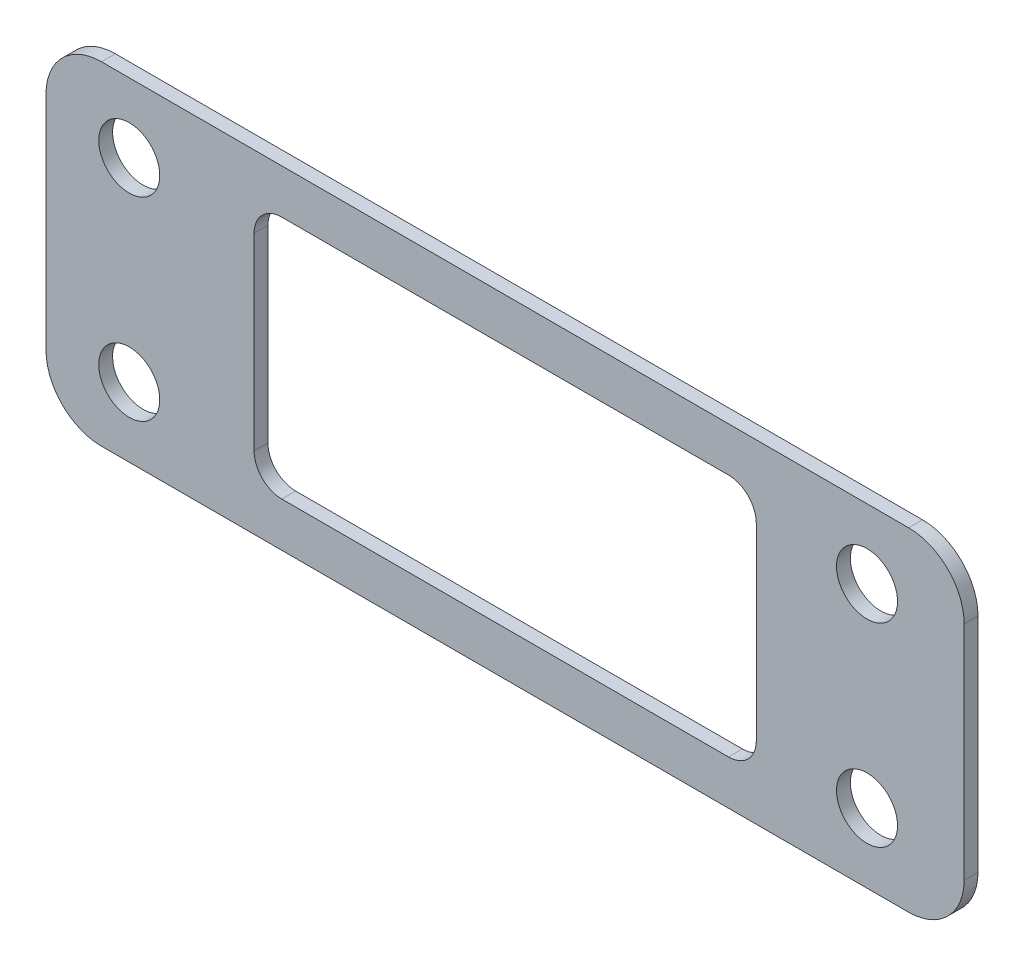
ISO-10303-21;
HEADER;
FILE_DESCRIPTION(('STEP AP214'),'2;1');
FILE_NAME('part.step','',(''),(''),'','','');
FILE_SCHEMA(('AUTOMOTIVE_DESIGN { 1 0 10303 214 1 1 1 1 }'));
ENDSEC;
DATA;
#1=APPLICATION_CONTEXT('core data for automotive mechanical design processes');
#2=APPLICATION_PROTOCOL_DEFINITION('international standard','automotive_design',2000,#1);
#3=PRODUCT_CONTEXT('',#1,'mechanical');
#4=PRODUCT('Part','Part','',(#3));
#5=PRODUCT_RELATED_PRODUCT_CATEGORY('part','',(#4));
#6=PRODUCT_DEFINITION_FORMATION('','',#4);
#7=PRODUCT_DEFINITION_CONTEXT('part definition',#1,'design');
#8=PRODUCT_DEFINITION('design','',#6,#7);
#9=PRODUCT_DEFINITION_SHAPE('','',#8);
#10=(LENGTH_UNIT() NAMED_UNIT(*) SI_UNIT(.MILLI.,.METRE.));
#11=(NAMED_UNIT(*) PLANE_ANGLE_UNIT() SI_UNIT($,.RADIAN.));
#12=(NAMED_UNIT(*) SI_UNIT($,.STERADIAN.) SOLID_ANGLE_UNIT());
#13=UNCERTAINTY_MEASURE_WITH_UNIT(LENGTH_MEASURE(1.E-05),#10,'distance_accuracy_value','');
#14=(GEOMETRIC_REPRESENTATION_CONTEXT(3) GLOBAL_UNCERTAINTY_ASSIGNED_CONTEXT((#13)) GLOBAL_UNIT_ASSIGNED_CONTEXT((#10,
#11,#12)) REPRESENTATION_CONTEXT('',''));
#15=CARTESIAN_POINT('',(0.,0.,0.));
#16=DIRECTION('',(0.,0.,1.));
#17=DIRECTION('',(1.,0.,0.));
#18=AXIS2_PLACEMENT_3D('',#15,#16,#17);
#19=CARTESIAN_POINT('',(818.894201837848,60.,-1011.41695165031));
#20=DIRECTION('',(0.,-1.,0.));
#21=DIRECTION('',(0.,0.,-1.));
#22=AXIS2_PLACEMENT_3D('',#19,#20,#21);
#23=PLANE('',#22);
#24=DIRECTION('',(-1.,0.,0.));
#25=VECTOR('',#24,1.);
#26=CARTESIAN_POINT('',(818.894201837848,60.,-1016.41695165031));
#27=LINE('',#26,#25);
#28=CARTESIAN_POINT('',(798.894201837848,60.,-1016.41695165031));
#29=VERTEX_POINT('',#28);
#30=CARTESIAN_POINT('',(507.97537091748,60.,-1016.41695165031));
#31=VERTEX_POINT('',#30);
#32=EDGE_CURVE('E296',#29,#31,#27,.T.);
#33=ORIENTED_EDGE('',*,*,#32,.T.);
#34=DIRECTION('',(0.,0.,1.));
#35=VECTOR('',#34,1.);
#36=CARTESIAN_POINT('',(507.97537091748,60.,-1011.41695165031));
#37=LINE('',#36,#35);
#38=CARTESIAN_POINT('',(507.97537091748,60.,-1011.41695165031));
#39=VERTEX_POINT('',#38);
#40=EDGE_CURVE('E166',#31,#39,#37,.T.);
#41=ORIENTED_EDGE('',*,*,#40,.T.);
#42=DIRECTION('',(-1.,0.,0.));
#43=VECTOR('',#42,1.);
#44=CARTESIAN_POINT('',(818.894201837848,60.,-1011.41695165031));
#45=LINE('',#44,#43);
#46=CARTESIAN_POINT('',(798.894201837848,60.,-1011.41695165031));
#47=VERTEX_POINT('',#46);
#48=EDGE_CURVE('E150',#47,#39,#45,.T.);
#49=ORIENTED_EDGE('',*,*,#48,.F.);
#50=DIRECTION('',(0.,0.,1.));
#51=VECTOR('',#50,1.);
#52=CARTESIAN_POINT('',(798.894201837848,60.,-1016.41695165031));
#53=LINE('',#52,#51);
#54=EDGE_CURVE('E163',#47,#29,#53,.F.);
#55=ORIENTED_EDGE('',*,*,#54,.T.);
#56=EDGE_LOOP('',(#33,#41,#49,#55));
#57=FACE_BOUND('',#56,.T.);
#58=ADVANCED_FACE('F34',(#57),#23,.F.);
#59=CARTESIAN_POINT('',(818.894201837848,-60.,-1011.41695165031));
#60=DIRECTION('',(0.,0.,-1.));
#61=DIRECTION('',(0.,1.,0.));
#62=AXIS2_PLACEMENT_3D('',#59,#60,#61);
#63=PLANE('',#62);
#64=DIRECTION('',(0.,1.,0.));
#65=VECTOR('',#64,1.);
#66=CARTESIAN_POINT('',(562.97537091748,44.0000000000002,-1011.41695165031));
#67=LINE('',#66,#65);
#68=CARTESIAN_POINT('',(562.97537091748,-34.0000000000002,-1011.41695165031));
#69=VERTEX_POINT('',#68);
#70=CARTESIAN_POINT('',(562.97537091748,34.0000000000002,-1011.41695165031));
#71=VERTEX_POINT('',#70);
#72=EDGE_CURVE('E249',#69,#71,#67,.T.);
#73=ORIENTED_EDGE('',*,*,#72,.T.);
#74=CARTESIAN_POINT('',(572.97537091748,34.0000000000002,-1011.41695165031));
#75=DIRECTION('',(0.,0.,-1.));
#76=DIRECTION('',(0.,1.,0.));
#77=AXIS2_PLACEMENT_3D('',#74,#75,#76);
#78=CIRCLE('',#77,10.);
#79=CARTESIAN_POINT('',(572.97537091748,44.0000000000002,-1011.41695165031));
#80=VERTEX_POINT('',#79);
#81=EDGE_CURVE('E230',#71,#80,#78,.T.);
#82=ORIENTED_EDGE('',*,*,#81,.T.);
#83=DIRECTION('',(1.,0.,0.));
#84=VECTOR('',#83,1.);
#85=CARTESIAN_POINT('',(743.97537091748,44.0000000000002,-1011.41695165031));
#86=LINE('',#85,#84);
#87=CARTESIAN_POINT('',(733.97537091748,44.0000000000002,-1011.41695165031));
#88=VERTEX_POINT('',#87);
#89=EDGE_CURVE('E251',#80,#88,#86,.T.);
#90=ORIENTED_EDGE('',*,*,#89,.T.);
#91=CARTESIAN_POINT('',(733.97537091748,34.0000000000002,-1011.41695165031));
#92=DIRECTION('',(0.,0.,-1.));
#93=DIRECTION('',(0.,1.,0.));
#94=AXIS2_PLACEMENT_3D('',#91,#92,#93);
#95=CIRCLE('',#94,10.);
#96=CARTESIAN_POINT('',(743.97537091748,34.0000000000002,-1011.41695165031));
#97=VERTEX_POINT('',#96);
#98=EDGE_CURVE('E222',#88,#97,#95,.T.);
#99=ORIENTED_EDGE('',*,*,#98,.T.);
#100=DIRECTION('',(0.,-1.,0.));
#101=VECTOR('',#100,1.);
#102=CARTESIAN_POINT('',(743.97537091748,44.0000000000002,-1011.41695165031));
#103=LINE('',#102,#101);
#104=CARTESIAN_POINT('',(743.97537091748,-34.0000000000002,-1011.41695165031));
#105=VERTEX_POINT('',#104);
#106=EDGE_CURVE('E257',#97,#105,#103,.T.);
#107=ORIENTED_EDGE('',*,*,#106,.T.);
#108=CARTESIAN_POINT('',(733.97537091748,-34.0000000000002,-1011.41695165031));
#109=DIRECTION('',(0.,0.,-1.));
#110=DIRECTION('',(0.,1.,0.));
#111=AXIS2_PLACEMENT_3D('',#108,#109,#110);
#112=CIRCLE('',#111,10.);
#113=CARTESIAN_POINT('',(733.97537091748,-44.0000000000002,-1011.41695165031));
#114=VERTEX_POINT('',#113);
#115=EDGE_CURVE('E226',#105,#114,#112,.T.);
#116=ORIENTED_EDGE('',*,*,#115,.T.);
#117=DIRECTION('',(-1.,0.,0.));
#118=VECTOR('',#117,1.);
#119=CARTESIAN_POINT('',(743.97537091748,-44.0000000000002,-1011.41695165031));
#120=LINE('',#119,#118);
#121=CARTESIAN_POINT('',(572.97537091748,-44.0000000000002,-1011.41695165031));
#122=VERTEX_POINT('',#121);
#123=EDGE_CURVE('E252',#114,#122,#120,.T.);
#124=ORIENTED_EDGE('',*,*,#123,.T.);
#125=CARTESIAN_POINT('',(572.97537091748,-34.0000000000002,-1011.41695165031));
#126=DIRECTION('',(0.,0.,-1.));
#127=DIRECTION('',(0.,1.,0.));
#128=AXIS2_PLACEMENT_3D('',#125,#126,#127);
#129=CIRCLE('',#128,10.);
#130=EDGE_CURVE('E11',#122,#69,#129,.T.);
#131=ORIENTED_EDGE('',*,*,#130,.T.);
#132=EDGE_LOOP('',(#73,#82,#90,#99,#107,#116,#124,#131));
#133=FACE_BOUND('',#132,.T.);
#134=CARTESIAN_POINT('',(783.894201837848,-35.,-1011.41695165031));
#135=DIRECTION('',(0.,0.,-1.));
#136=DIRECTION('',(0.,1.,0.));
#137=AXIS2_PLACEMENT_3D('',#134,#135,#136);
#138=CIRCLE('',#137,11.);
#139=CARTESIAN_POINT('',(783.894201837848,-24.,-1011.41695165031));
#140=VERTEX_POINT('',#139);
#141=EDGE_CURVE('E287',#140,#140,#138,.T.);
#142=ORIENTED_EDGE('',*,*,#141,.T.);
#143=EDGE_LOOP('',(#142));
#144=FACE_BOUND('',#143,.T.);
#145=CARTESIAN_POINT('',(517.97537091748,35.,-1011.41695165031));
#146=DIRECTION('',(0.,0.,-1.));
#147=DIRECTION('',(0.,1.,0.));
#148=AXIS2_PLACEMENT_3D('',#145,#146,#147);
#149=CIRCLE('',#148,11.);
#150=CARTESIAN_POINT('',(517.97537091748,46.,-1011.41695165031));
#151=VERTEX_POINT('',#150);
#152=EDGE_CURVE('E284',#151,#151,#149,.T.);
#153=ORIENTED_EDGE('',*,*,#152,.T.);
#154=EDGE_LOOP('',(#153));
#155=FACE_BOUND('',#154,.T.);
#156=CARTESIAN_POINT('',(517.97537091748,-35.,-1011.41695165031));
#157=DIRECTION('',(0.,0.,-1.));
#158=DIRECTION('',(0.,1.,0.));
#159=AXIS2_PLACEMENT_3D('',#156,#157,#158);
#160=CIRCLE('',#159,11.);
#161=CARTESIAN_POINT('',(517.97537091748,-24.,-1011.41695165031));
#162=VERTEX_POINT('',#161);
#163=EDGE_CURVE('E281',#162,#162,#160,.T.);
#164=ORIENTED_EDGE('',*,*,#163,.T.);
#165=EDGE_LOOP('',(#164));
#166=FACE_BOUND('',#165,.T.);
#167=CARTESIAN_POINT('',(783.894201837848,35.,-1011.41695165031));
#168=DIRECTION('',(0.,0.,-1.));
#169=DIRECTION('',(0.,1.,0.));
#170=AXIS2_PLACEMENT_3D('',#167,#168,#169);
#171=CIRCLE('',#170,11.);
#172=CARTESIAN_POINT('',(783.894201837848,46.,-1011.41695165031));
#173=VERTEX_POINT('',#172);
#174=EDGE_CURVE('E278',#173,#173,#171,.T.);
#175=ORIENTED_EDGE('',*,*,#174,.T.);
#176=EDGE_LOOP('',(#175));
#177=FACE_BOUND('',#176,.T.);
#178=ORIENTED_EDGE('',*,*,#48,.T.);
#179=CARTESIAN_POINT('',(507.97537091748,40.,-1011.41695165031));
#180=DIRECTION('',(0.,0.,-1.));
#181=DIRECTION('',(0.,1.,0.));
#182=AXIS2_PLACEMENT_3D('',#179,#180,#181);
#183=CIRCLE('',#182,20.);
#184=CARTESIAN_POINT('',(487.97537091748,39.9999999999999,-1011.41695165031));
#185=VERTEX_POINT('',#184);
#186=EDGE_CURVE('E178',#39,#185,#183,.F.);
#187=ORIENTED_EDGE('',*,*,#186,.T.);
#188=DIRECTION('',(0.,-1.,0.));
#189=VECTOR('',#188,1.);
#190=CARTESIAN_POINT('',(487.97537091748,-60.,-1011.41695165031));
#191=LINE('',#190,#189);
#192=CARTESIAN_POINT('',(487.97537091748,-40.,-1011.41695165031));
#193=VERTEX_POINT('',#192);
#194=EDGE_CURVE('E290',#185,#193,#191,.T.);
#195=ORIENTED_EDGE('',*,*,#194,.T.);
#196=CARTESIAN_POINT('',(507.97537091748,-40.,-1011.41695165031));
#197=DIRECTION('',(0.,0.,-1.));
#198=DIRECTION('',(0.,1.,0.));
#199=AXIS2_PLACEMENT_3D('',#196,#197,#198);
#200=CIRCLE('',#199,20.);
#201=CARTESIAN_POINT('',(507.97537091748,-60.,-1011.41695165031));
#202=VERTEX_POINT('',#201);
#203=EDGE_CURVE('E157',#193,#202,#200,.F.);
#204=ORIENTED_EDGE('',*,*,#203,.T.);
#205=DIRECTION('',(-1.,0.,0.));
#206=VECTOR('',#205,1.);
#207=CARTESIAN_POINT('',(818.894201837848,-60.,-1011.41695165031));
#208=LINE('',#207,#206);
#209=CARTESIAN_POINT('',(798.894201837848,-60.,-1011.41695165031));
#210=VERTEX_POINT('',#209);
#211=EDGE_CURVE('E167',#210,#202,#208,.T.);
#212=ORIENTED_EDGE('',*,*,#211,.F.);
#213=CARTESIAN_POINT('',(798.894201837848,-40.,-1011.41695165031));
#214=DIRECTION('',(0.,0.,-1.));
#215=DIRECTION('',(0.,1.,0.));
#216=AXIS2_PLACEMENT_3D('',#213,#214,#215);
#217=CIRCLE('',#216,20.);
#218=CARTESIAN_POINT('',(818.894201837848,-40.,-1011.41695165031));
#219=VERTEX_POINT('',#218);
#220=EDGE_CURVE('E158',#210,#219,#217,.F.);
#221=ORIENTED_EDGE('',*,*,#220,.T.);
#222=DIRECTION('',(0.,-1.,0.));
#223=VECTOR('',#222,1.);
#224=CARTESIAN_POINT('',(818.894201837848,-60.,-1011.41695165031));
#225=LINE('',#224,#223);
#226=CARTESIAN_POINT('',(818.894201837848,39.9999999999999,-1011.41695165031));
#227=VERTEX_POINT('',#226);
#228=EDGE_CURVE('E152',#227,#219,#225,.T.);
#229=ORIENTED_EDGE('',*,*,#228,.F.);
#230=CARTESIAN_POINT('',(798.894201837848,40.,-1011.41695165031));
#231=DIRECTION('',(0.,0.,-1.));
#232=DIRECTION('',(0.,1.,0.));
#233=AXIS2_PLACEMENT_3D('',#230,#231,#232);
#234=CIRCLE('',#233,20.);
#235=EDGE_CURVE('E147',#227,#47,#234,.F.);
#236=ORIENTED_EDGE('',*,*,#235,.T.);
#237=EDGE_LOOP('',(#178,#187,#195,#204,#212,#221,#229,#236));
#238=FACE_BOUND('',#237,.T.);
#239=ADVANCED_FACE('F149',(#133,#144,#155,#166,#177,#238),#63,.F.);
#240=CARTESIAN_POINT('',(818.894201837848,-60.,-1011.41695165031));
#241=DIRECTION('',(0.,1.,0.));
#242=DIRECTION('',(0.,0.,1.));
#243=AXIS2_PLACEMENT_3D('',#240,#241,#242);
#244=PLANE('',#243);
#245=ORIENTED_EDGE('',*,*,#211,.T.);
#246=DIRECTION('',(0.,0.,-1.));
#247=VECTOR('',#246,1.);
#248=CARTESIAN_POINT('',(507.97537091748,-60.,-1011.41695165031));
#249=LINE('',#248,#247);
#250=CARTESIAN_POINT('',(507.97537091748,-60.,-1016.41695165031));
#251=VERTEX_POINT('',#250);
#252=EDGE_CURVE('E193',#202,#251,#249,.T.);
#253=ORIENTED_EDGE('',*,*,#252,.T.);
#254=DIRECTION('',(-1.,0.,0.));
#255=VECTOR('',#254,1.);
#256=CARTESIAN_POINT('',(818.894201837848,-60.,-1016.41695165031));
#257=LINE('',#256,#255);
#258=CARTESIAN_POINT('',(798.894201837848,-60.,-1016.41695165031));
#259=VERTEX_POINT('',#258);
#260=EDGE_CURVE('E302',#259,#251,#257,.T.);
#261=ORIENTED_EDGE('',*,*,#260,.F.);
#262=DIRECTION('',(0.,0.,-1.));
#263=VECTOR('',#262,1.);
#264=CARTESIAN_POINT('',(798.894201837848,-60.,-1011.41695165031));
#265=LINE('',#264,#263);
#266=EDGE_CURVE('E191',#259,#210,#265,.F.);
#267=ORIENTED_EDGE('',*,*,#266,.T.);
#268=EDGE_LOOP('',(#245,#253,#261,#267));
#269=FACE_BOUND('',#268,.T.);
#270=ADVANCED_FACE('F308',(#269),#244,.F.);
#271=CARTESIAN_POINT('',(818.894201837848,-60.,-1016.41695165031));
#272=DIRECTION('',(0.,0.,1.));
#273=DIRECTION('',(0.,-1.,0.));
#274=AXIS2_PLACEMENT_3D('',#271,#272,#273);
#275=PLANE('',#274);
#276=DIRECTION('',(-1.,0.,0.));
#277=VECTOR('',#276,1.);
#278=CARTESIAN_POINT('',(743.97537091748,-44.0000000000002,-1016.41695165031));
#279=LINE('',#278,#277);
#280=CARTESIAN_POINT('',(733.97537091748,-44.0000000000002,-1016.41695165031));
#281=VERTEX_POINT('',#280);
#282=CARTESIAN_POINT('',(572.97537091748,-44.0000000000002,-1016.41695165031));
#283=VERTEX_POINT('',#282);
#284=EDGE_CURVE('E237',#281,#283,#279,.T.);
#285=ORIENTED_EDGE('',*,*,#284,.F.);
#286=CARTESIAN_POINT('',(733.97537091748,-34.0000000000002,-1016.41695165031));
#287=DIRECTION('',(0.,0.,1.));
#288=DIRECTION('',(0.,-1.,0.));
#289=AXIS2_PLACEMENT_3D('',#286,#287,#288);
#290=CIRCLE('',#289,10.);
#291=CARTESIAN_POINT('',(743.97537091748,-34.0000000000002,-1016.41695165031));
#292=VERTEX_POINT('',#291);
#293=EDGE_CURVE('E224',#281,#292,#290,.T.);
#294=ORIENTED_EDGE('',*,*,#293,.T.);
#295=DIRECTION('',(0.,-1.,0.));
#296=VECTOR('',#295,1.);
#297=CARTESIAN_POINT('',(743.97537091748,44.0000000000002,-1016.41695165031));
#298=LINE('',#297,#296);
#299=CARTESIAN_POINT('',(743.97537091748,34.0000000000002,-1016.41695165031));
#300=VERTEX_POINT('',#299);
#301=EDGE_CURVE('E246',#300,#292,#298,.T.);
#302=ORIENTED_EDGE('',*,*,#301,.F.);
#303=CARTESIAN_POINT('',(733.97537091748,34.0000000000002,-1016.41695165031));
#304=DIRECTION('',(0.,0.,1.));
#305=DIRECTION('',(0.,-1.,0.));
#306=AXIS2_PLACEMENT_3D('',#303,#304,#305);
#307=CIRCLE('',#306,10.);
#308=CARTESIAN_POINT('',(733.97537091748,44.0000000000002,-1016.41695165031));
#309=VERTEX_POINT('',#308);
#310=EDGE_CURVE('E220',#300,#309,#307,.T.);
#311=ORIENTED_EDGE('',*,*,#310,.T.);
#312=DIRECTION('',(1.,0.,0.));
#313=VECTOR('',#312,1.);
#314=CARTESIAN_POINT('',(743.97537091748,44.0000000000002,-1016.41695165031));
#315=LINE('',#314,#313);
#316=CARTESIAN_POINT('',(572.97537091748,44.0000000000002,-1016.41695165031));
#317=VERTEX_POINT('',#316);
#318=EDGE_CURVE('E264',#317,#309,#315,.T.);
#319=ORIENTED_EDGE('',*,*,#318,.F.);
#320=CARTESIAN_POINT('',(572.97537091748,34.0000000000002,-1016.41695165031));
#321=DIRECTION('',(0.,0.,1.));
#322=DIRECTION('',(0.,-1.,0.));
#323=AXIS2_PLACEMENT_3D('',#320,#321,#322);
#324=CIRCLE('',#323,10.);
#325=CARTESIAN_POINT('',(562.97537091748,34.0000000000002,-1016.41695165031));
#326=VERTEX_POINT('',#325);
#327=EDGE_CURVE('E228',#317,#326,#324,.T.);
#328=ORIENTED_EDGE('',*,*,#327,.T.);
#329=DIRECTION('',(0.,1.,0.));
#330=VECTOR('',#329,1.);
#331=CARTESIAN_POINT('',(562.97537091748,44.0000000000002,-1016.41695165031));
#332=LINE('',#331,#330);
#333=CARTESIAN_POINT('',(562.97537091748,-34.0000000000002,-1016.41695165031));
#334=VERTEX_POINT('',#333);
#335=EDGE_CURVE('E238',#334,#326,#332,.T.);
#336=ORIENTED_EDGE('',*,*,#335,.F.);
#337=CARTESIAN_POINT('',(572.97537091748,-34.0000000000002,-1016.41695165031));
#338=DIRECTION('',(0.,0.,1.));
#339=DIRECTION('',(0.,-1.,0.));
#340=AXIS2_PLACEMENT_3D('',#337,#338,#339);
#341=CIRCLE('',#340,10.);
#342=EDGE_CURVE('E42',#334,#283,#341,.T.);
#343=ORIENTED_EDGE('',*,*,#342,.T.);
#344=EDGE_LOOP('',(#285,#294,#302,#311,#319,#328,#336,#343));
#345=FACE_BOUND('',#344,.T.);
#346=CARTESIAN_POINT('',(783.894201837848,-35.,-1016.41695165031));
#347=DIRECTION('',(0.,0.,-1.));
#348=DIRECTION('',(0.,1.,0.));
#349=AXIS2_PLACEMENT_3D('',#346,#347,#348);
#350=CIRCLE('',#349,11.);
#351=CARTESIAN_POINT('',(783.894201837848,-24.,-1016.41695165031));
#352=VERTEX_POINT('',#351);
#353=EDGE_CURVE('E270',#352,#352,#350,.T.);
#354=ORIENTED_EDGE('',*,*,#353,.F.);
#355=EDGE_LOOP('',(#354));
#356=FACE_BOUND('',#355,.T.);
#357=CARTESIAN_POINT('',(517.97537091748,35.,-1016.41695165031));
#358=DIRECTION('',(0.,0.,-1.));
#359=DIRECTION('',(0.,1.,0.));
#360=AXIS2_PLACEMENT_3D('',#357,#358,#359);
#361=CIRCLE('',#360,11.);
#362=CARTESIAN_POINT('',(517.97537091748,46.,-1016.41695165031));
#363=VERTEX_POINT('',#362);
#364=EDGE_CURVE('E269',#363,#363,#361,.T.);
#365=ORIENTED_EDGE('',*,*,#364,.F.);
#366=EDGE_LOOP('',(#365));
#367=FACE_BOUND('',#366,.T.);
#368=CARTESIAN_POINT('',(517.97537091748,-35.,-1016.41695165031));
#369=DIRECTION('',(0.,0.,-1.));
#370=DIRECTION('',(0.,1.,0.));
#371=AXIS2_PLACEMENT_3D('',#368,#369,#370);
#372=CIRCLE('',#371,11.);
#373=CARTESIAN_POINT('',(517.97537091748,-24.,-1016.41695165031));
#374=VERTEX_POINT('',#373);
#375=EDGE_CURVE('E255',#374,#374,#372,.T.);
#376=ORIENTED_EDGE('',*,*,#375,.F.);
#377=EDGE_LOOP('',(#376));
#378=FACE_BOUND('',#377,.T.);
#379=CARTESIAN_POINT('',(783.894201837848,35.,-1016.41695165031));
#380=DIRECTION('',(0.,0.,-1.));
#381=DIRECTION('',(0.,1.,0.));
#382=AXIS2_PLACEMENT_3D('',#379,#380,#381);
#383=CIRCLE('',#382,11.);
#384=CARTESIAN_POINT('',(783.894201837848,46.,-1016.41695165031));
#385=VERTEX_POINT('',#384);
#386=EDGE_CURVE('E273',#385,#385,#383,.T.);
#387=ORIENTED_EDGE('',*,*,#386,.F.);
#388=EDGE_LOOP('',(#387));
#389=FACE_BOUND('',#388,.T.);
#390=DIRECTION('',(0.,1.,0.));
#391=VECTOR('',#390,1.);
#392=CARTESIAN_POINT('',(487.97537091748,-60.,-1016.41695165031));
#393=LINE('',#392,#391);
#394=CARTESIAN_POINT('',(487.97537091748,-40.,-1016.41695165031));
#395=VERTEX_POINT('',#394);
#396=CARTESIAN_POINT('',(487.97537091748,40.,-1016.41695165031));
#397=VERTEX_POINT('',#396);
#398=EDGE_CURVE('E293',#395,#397,#393,.T.);
#399=ORIENTED_EDGE('',*,*,#398,.T.);
#400=CARTESIAN_POINT('',(507.97537091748,40.,-1016.41695165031));
#401=DIRECTION('',(0.,0.,1.));
#402=DIRECTION('',(0.,-1.,0.));
#403=AXIS2_PLACEMENT_3D('',#400,#401,#402);
#404=CIRCLE('',#403,20.);
#405=EDGE_CURVE('E189',#397,#31,#404,.F.);
#406=ORIENTED_EDGE('',*,*,#405,.T.);
#407=ORIENTED_EDGE('',*,*,#32,.F.);
#408=CARTESIAN_POINT('',(798.894201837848,40.,-1016.41695165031));
#409=DIRECTION('',(0.,0.,1.));
#410=DIRECTION('',(0.,-1.,0.));
#411=AXIS2_PLACEMENT_3D('',#408,#409,#410);
#412=CIRCLE('',#411,20.);
#413=CARTESIAN_POINT('',(818.894201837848,40.,-1016.41695165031));
#414=VERTEX_POINT('',#413);
#415=EDGE_CURVE('E171',#29,#414,#412,.F.);
#416=ORIENTED_EDGE('',*,*,#415,.T.);
#417=DIRECTION('',(0.,1.,0.));
#418=VECTOR('',#417,1.);
#419=CARTESIAN_POINT('',(818.894201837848,-60.,-1016.41695165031));
#420=LINE('',#419,#418);
#421=CARTESIAN_POINT('',(818.894201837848,-40.,-1016.41695165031));
#422=VERTEX_POINT('',#421);
#423=EDGE_CURVE('E292',#422,#414,#420,.T.);
#424=ORIENTED_EDGE('',*,*,#423,.F.);
#425=CARTESIAN_POINT('',(798.894201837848,-40.,-1016.41695165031));
#426=DIRECTION('',(0.,0.,1.));
#427=DIRECTION('',(0.,-1.,0.));
#428=AXIS2_PLACEMENT_3D('',#425,#426,#427);
#429=CIRCLE('',#428,20.);
#430=EDGE_CURVE('E184',#422,#259,#429,.F.);
#431=ORIENTED_EDGE('',*,*,#430,.T.);
#432=ORIENTED_EDGE('',*,*,#260,.T.);
#433=CARTESIAN_POINT('',(507.97537091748,-40.,-1016.41695165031));
#434=DIRECTION('',(0.,0.,1.));
#435=DIRECTION('',(0.,-1.,0.));
#436=AXIS2_PLACEMENT_3D('',#433,#434,#435);
#437=CIRCLE('',#436,20.);
#438=EDGE_CURVE('E187',#251,#395,#437,.F.);
#439=ORIENTED_EDGE('',*,*,#438,.T.);
#440=EDGE_LOOP('',(#399,#406,#407,#416,#424,#431,#432,#439));
#441=FACE_BOUND('',#440,.T.);
#442=ADVANCED_FACE('F235',(#345,#356,#367,#378,#389,#441),#275,.F.);
#443=CARTESIAN_POINT('',(818.894201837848,0.,0.));
#444=DIRECTION('',(1.,0.,0.));
#445=DIRECTION('',(0.,0.,-1.));
#446=AXIS2_PLACEMENT_3D('',#443,#444,#445);
#447=PLANE('',#446);
#448=ORIENTED_EDGE('',*,*,#423,.T.);
#449=DIRECTION('',(0.,0.,1.));
#450=VECTOR('',#449,1.);
#451=CARTESIAN_POINT('',(818.894201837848,40.,-1011.41695165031));
#452=LINE('',#451,#450);
#453=EDGE_CURVE('E199',#414,#227,#452,.T.);
#454=ORIENTED_EDGE('',*,*,#453,.T.);
#455=ORIENTED_EDGE('',*,*,#228,.T.);
#456=DIRECTION('',(0.,0.,-1.));
#457=VECTOR('',#456,1.);
#458=CARTESIAN_POINT('',(818.894201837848,-40.,-1016.41695165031));
#459=LINE('',#458,#457);
#460=EDGE_CURVE('E196',#219,#422,#459,.T.);
#461=ORIENTED_EDGE('',*,*,#460,.T.);
#462=EDGE_LOOP('',(#448,#454,#455,#461));
#463=FACE_BOUND('',#462,.T.);
#464=ADVANCED_FACE('F327',(#463),#447,.T.);
#465=CARTESIAN_POINT('',(487.97537091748,0.,0.));
#466=DIRECTION('',(1.,0.,0.));
#467=DIRECTION('',(0.,0.,-1.));
#468=AXIS2_PLACEMENT_3D('',#465,#466,#467);
#469=PLANE('',#468);
#470=ORIENTED_EDGE('',*,*,#194,.F.);
#471=DIRECTION('',(0.,0.,1.));
#472=VECTOR('',#471,1.);
#473=CARTESIAN_POINT('',(487.97537091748,39.9999999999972,1.1102230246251E-13));
#474=LINE('',#473,#472);
#475=EDGE_CURVE('E182',#185,#397,#474,.F.);
#476=ORIENTED_EDGE('',*,*,#475,.T.);
#477=ORIENTED_EDGE('',*,*,#398,.F.);
#478=DIRECTION('',(0.,0.,-1.));
#479=VECTOR('',#478,1.);
#480=CARTESIAN_POINT('',(487.97537091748,-40.0000000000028,-1.11022302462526E-13));
#481=LINE('',#480,#479);
#482=EDGE_CURVE('E180',#395,#193,#481,.F.);
#483=ORIENTED_EDGE('',*,*,#482,.T.);
#484=EDGE_LOOP('',(#470,#476,#477,#483));
#485=FACE_BOUND('',#484,.T.);
#486=ADVANCED_FACE('F321',(#485),#469,.F.);
#487=CARTESIAN_POINT('',(507.97537091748,40.,-1011.41695165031));
#488=DIRECTION('',(0.,0.,1.));
#489=DIRECTION('',(0.,-1.,0.));
#490=AXIS2_PLACEMENT_3D('',#487,#488,#489);
#491=CYLINDRICAL_SURFACE('',#490,20.);
#492=ORIENTED_EDGE('',*,*,#405,.F.);
#493=ORIENTED_EDGE('',*,*,#475,.F.);
#494=ORIENTED_EDGE('',*,*,#186,.F.);
#495=ORIENTED_EDGE('',*,*,#40,.F.);
#496=EDGE_LOOP('',(#492,#493,#494,#495));
#497=FACE_BOUND('',#496,.T.);
#498=ADVANCED_FACE('F324',(#497),#491,.T.);
#499=CARTESIAN_POINT('',(507.97537091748,-40.,-1011.41695165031));
#500=DIRECTION('',(0.,0.,-1.));
#501=DIRECTION('',(0.,1.,0.));
#502=AXIS2_PLACEMENT_3D('',#499,#500,#501);
#503=CYLINDRICAL_SURFACE('',#502,20.);
#504=ORIENTED_EDGE('',*,*,#203,.F.);
#505=ORIENTED_EDGE('',*,*,#482,.F.);
#506=ORIENTED_EDGE('',*,*,#438,.F.);
#507=ORIENTED_EDGE('',*,*,#252,.F.);
#508=EDGE_LOOP('',(#504,#505,#506,#507));
#509=FACE_BOUND('',#508,.T.);
#510=ADVANCED_FACE('F314',(#509),#503,.T.);
#511=CARTESIAN_POINT('',(798.894201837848,39.9999999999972,1.1102230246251E-13));
#512=DIRECTION('',(0.,0.,-1.));
#513=DIRECTION('',(0.,1.,0.));
#514=AXIS2_PLACEMENT_3D('',#511,#512,#513);
#515=CYLINDRICAL_SURFACE('',#514,20.);
#516=ORIENTED_EDGE('',*,*,#415,.F.);
#517=ORIENTED_EDGE('',*,*,#54,.F.);
#518=ORIENTED_EDGE('',*,*,#235,.F.);
#519=ORIENTED_EDGE('',*,*,#453,.F.);
#520=EDGE_LOOP('',(#516,#517,#518,#519));
#521=FACE_BOUND('',#520,.T.);
#522=ADVANCED_FACE('F170',(#521),#515,.T.);
#523=CARTESIAN_POINT('',(798.894201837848,-40.0000000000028,-1.11022302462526E-13));
#524=DIRECTION('',(0.,0.,1.));
#525=DIRECTION('',(0.,-1.,0.));
#526=AXIS2_PLACEMENT_3D('',#523,#524,#525);
#527=CYLINDRICAL_SURFACE('',#526,20.);
#528=ORIENTED_EDGE('',*,*,#220,.F.);
#529=ORIENTED_EDGE('',*,*,#266,.F.);
#530=ORIENTED_EDGE('',*,*,#430,.F.);
#531=ORIENTED_EDGE('',*,*,#460,.F.);
#532=EDGE_LOOP('',(#528,#529,#530,#531));
#533=FACE_BOUND('',#532,.T.);
#534=ADVANCED_FACE('F330',(#533),#527,.T.);
#535=CARTESIAN_POINT('',(783.894201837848,34.9999999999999,-996.416951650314));
#536=DIRECTION('',(0.,0.,-1.));
#537=DIRECTION('',(0.,1.,0.));
#538=AXIS2_PLACEMENT_3D('',#535,#536,#537);
#539=CYLINDRICAL_SURFACE('',#538,11.);
#540=ORIENTED_EDGE('',*,*,#386,.T.);
#541=EDGE_LOOP('',(#540));
#542=FACE_BOUND('',#541,.T.);
#543=ORIENTED_EDGE('',*,*,#174,.F.);
#544=EDGE_LOOP('',(#543));
#545=FACE_BOUND('',#544,.T.);
#546=ADVANCED_FACE('F332',(#542,#545),#539,.F.);
#547=CARTESIAN_POINT('',(517.97537091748,-35.0000000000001,-996.416951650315));
#548=DIRECTION('',(0.,0.,-1.));
#549=DIRECTION('',(0.,1.,0.));
#550=AXIS2_PLACEMENT_3D('',#547,#548,#549);
#551=CYLINDRICAL_SURFACE('',#550,11.);
#552=ORIENTED_EDGE('',*,*,#375,.T.);
#553=EDGE_LOOP('',(#552));
#554=FACE_BOUND('',#553,.T.);
#555=ORIENTED_EDGE('',*,*,#163,.F.);
#556=EDGE_LOOP('',(#555));
#557=FACE_BOUND('',#556,.T.);
#558=ADVANCED_FACE('F338',(#554,#557),#551,.F.);
#559=CARTESIAN_POINT('',(517.97537091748,34.9999999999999,-996.416951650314));
#560=DIRECTION('',(0.,0.,-1.));
#561=DIRECTION('',(0.,1.,0.));
#562=AXIS2_PLACEMENT_3D('',#559,#560,#561);
#563=CYLINDRICAL_SURFACE('',#562,11.);
#564=ORIENTED_EDGE('',*,*,#364,.T.);
#565=EDGE_LOOP('',(#564));
#566=FACE_BOUND('',#565,.T.);
#567=ORIENTED_EDGE('',*,*,#152,.F.);
#568=EDGE_LOOP('',(#567));
#569=FACE_BOUND('',#568,.T.);
#570=ADVANCED_FACE('F414',(#566,#569),#563,.F.);
#571=CARTESIAN_POINT('',(783.894201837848,-35.0000000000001,-996.416951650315));
#572=DIRECTION('',(0.,0.,-1.));
#573=DIRECTION('',(0.,1.,0.));
#574=AXIS2_PLACEMENT_3D('',#571,#572,#573);
#575=CYLINDRICAL_SURFACE('',#574,11.);
#576=ORIENTED_EDGE('',*,*,#353,.T.);
#577=EDGE_LOOP('',(#576));
#578=FACE_BOUND('',#577,.T.);
#579=ORIENTED_EDGE('',*,*,#141,.F.);
#580=EDGE_LOOP('',(#579));
#581=FACE_BOUND('',#580,.T.);
#582=ADVANCED_FACE('F419',(#578,#581),#575,.F.);
#583=CARTESIAN_POINT('',(743.97537091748,44.0000000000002,-1011.41695165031));
#584=DIRECTION('',(1.,0.,0.));
#585=DIRECTION('',(0.,1.,0.));
#586=AXIS2_PLACEMENT_3D('',#583,#584,#585);
#587=PLANE('',#586);
#588=ORIENTED_EDGE('',*,*,#106,.F.);
#589=DIRECTION('',(0.,0.,-1.));
#590=VECTOR('',#589,1.);
#591=CARTESIAN_POINT('',(743.97537091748,34.0000000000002,-1016.41695165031));
#592=LINE('',#591,#590);
#593=EDGE_CURVE('E203',#97,#300,#592,.T.);
#594=ORIENTED_EDGE('',*,*,#593,.T.);
#595=ORIENTED_EDGE('',*,*,#301,.T.);
#596=DIRECTION('',(0.,0.,-1.));
#597=VECTOR('',#596,1.);
#598=CARTESIAN_POINT('',(743.97537091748,-34.0000000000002,-1011.41695165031));
#599=LINE('',#598,#597);
#600=EDGE_CURVE('E201',#292,#105,#599,.F.);
#601=ORIENTED_EDGE('',*,*,#600,.T.);
#602=EDGE_LOOP('',(#588,#594,#595,#601));
#603=FACE_BOUND('',#602,.T.);
#604=ADVANCED_FACE('F428',(#603),#587,.F.);
#605=CARTESIAN_POINT('',(743.97537091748,44.0000000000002,-1011.41695165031));
#606=DIRECTION('',(0.,1.,0.));
#607=DIRECTION('',(0.,0.,1.));
#608=AXIS2_PLACEMENT_3D('',#605,#606,#607);
#609=PLANE('',#608);
#610=ORIENTED_EDGE('',*,*,#318,.T.);
#611=DIRECTION('',(0.,0.,-1.));
#612=VECTOR('',#611,1.);
#613=CARTESIAN_POINT('',(733.97537091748,44.0000000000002,-1011.41695165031));
#614=LINE('',#613,#612);
#615=EDGE_CURVE('E209',#309,#88,#614,.F.);
#616=ORIENTED_EDGE('',*,*,#615,.T.);
#617=ORIENTED_EDGE('',*,*,#89,.F.);
#618=DIRECTION('',(0.,0.,-1.));
#619=VECTOR('',#618,1.);
#620=CARTESIAN_POINT('',(572.97537091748,44.0000000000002,-1016.41695165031));
#621=LINE('',#620,#619);
#622=EDGE_CURVE('E206',#80,#317,#621,.T.);
#623=ORIENTED_EDGE('',*,*,#622,.T.);
#624=EDGE_LOOP('',(#610,#616,#617,#623));
#625=FACE_BOUND('',#624,.T.);
#626=ADVANCED_FACE('F445',(#625),#609,.F.);
#627=CARTESIAN_POINT('',(562.97537091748,44.0000000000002,-1011.41695165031));
#628=DIRECTION('',(-1.,0.,0.));
#629=DIRECTION('',(0.,0.,1.));
#630=AXIS2_PLACEMENT_3D('',#627,#628,#629);
#631=PLANE('',#630);
#632=ORIENTED_EDGE('',*,*,#335,.T.);
#633=DIRECTION('',(0.,0.,-1.));
#634=VECTOR('',#633,1.);
#635=CARTESIAN_POINT('',(562.97537091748,34.0000000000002,-1011.41695165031));
#636=LINE('',#635,#634);
#637=EDGE_CURVE('E49',#326,#71,#636,.F.);
#638=ORIENTED_EDGE('',*,*,#637,.T.);
#639=ORIENTED_EDGE('',*,*,#72,.F.);
#640=DIRECTION('',(0.,0.,-1.));
#641=VECTOR('',#640,1.);
#642=CARTESIAN_POINT('',(562.97537091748,-34.0000000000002,-1016.41695165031));
#643=LINE('',#642,#641);
#644=EDGE_CURVE('E216',#69,#334,#643,.T.);
#645=ORIENTED_EDGE('',*,*,#644,.T.);
#646=EDGE_LOOP('',(#632,#638,#639,#645));
#647=FACE_BOUND('',#646,.T.);
#648=ADVANCED_FACE('F248',(#647),#631,.F.);
#649=CARTESIAN_POINT('',(743.97537091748,-44.0000000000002,-1011.41695165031));
#650=DIRECTION('',(0.,-1.,0.));
#651=DIRECTION('',(0.,0.,-1.));
#652=AXIS2_PLACEMENT_3D('',#649,#650,#651);
#653=PLANE('',#652);
#654=ORIENTED_EDGE('',*,*,#123,.F.);
#655=DIRECTION('',(0.,0.,-1.));
#656=VECTOR('',#655,1.);
#657=CARTESIAN_POINT('',(733.97537091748,-44.0000000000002,-1016.41695165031));
#658=LINE('',#657,#656);
#659=EDGE_CURVE('E213',#114,#281,#658,.T.);
#660=ORIENTED_EDGE('',*,*,#659,.T.);
#661=ORIENTED_EDGE('',*,*,#284,.T.);
#662=DIRECTION('',(0.,0.,-1.));
#663=VECTOR('',#662,1.);
#664=CARTESIAN_POINT('',(572.97537091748,-44.0000000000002,-1011.41695165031));
#665=LINE('',#664,#663);
#666=EDGE_CURVE('E211',#283,#122,#665,.F.);
#667=ORIENTED_EDGE('',*,*,#666,.T.);
#668=EDGE_LOOP('',(#654,#660,#661,#667));
#669=FACE_BOUND('',#668,.T.);
#670=ADVANCED_FACE('F244',(#669),#653,.F.);
#671=CARTESIAN_POINT('',(733.97537091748,34.0000000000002,-1011.41695165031));
#672=DIRECTION('',(0.,0.,1.));
#673=DIRECTION('',(0.,-1.,0.));
#674=AXIS2_PLACEMENT_3D('',#671,#672,#673);
#675=CYLINDRICAL_SURFACE('',#674,10.);
#676=ORIENTED_EDGE('',*,*,#98,.F.);
#677=ORIENTED_EDGE('',*,*,#615,.F.);
#678=ORIENTED_EDGE('',*,*,#310,.F.);
#679=ORIENTED_EDGE('',*,*,#593,.F.);
#680=EDGE_LOOP('',(#676,#677,#678,#679));
#681=FACE_BOUND('',#680,.T.);
#682=ADVANCED_FACE('F454',(#681),#675,.F.);
#683=CARTESIAN_POINT('',(733.97537091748,-34.0000000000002,-1011.41695165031));
#684=DIRECTION('',(0.,0.,1.));
#685=DIRECTION('',(0.,-1.,0.));
#686=AXIS2_PLACEMENT_3D('',#683,#684,#685);
#687=CYLINDRICAL_SURFACE('',#686,10.);
#688=ORIENTED_EDGE('',*,*,#115,.F.);
#689=ORIENTED_EDGE('',*,*,#600,.F.);
#690=ORIENTED_EDGE('',*,*,#293,.F.);
#691=ORIENTED_EDGE('',*,*,#659,.F.);
#692=EDGE_LOOP('',(#688,#689,#690,#691));
#693=FACE_BOUND('',#692,.T.);
#694=ADVANCED_FACE('F473',(#693),#687,.F.);
#695=CARTESIAN_POINT('',(572.97537091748,34.0000000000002,-1011.41695165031));
#696=DIRECTION('',(0.,0.,1.));
#697=DIRECTION('',(0.,-1.,0.));
#698=AXIS2_PLACEMENT_3D('',#695,#696,#697);
#699=CYLINDRICAL_SURFACE('',#698,10.);
#700=ORIENTED_EDGE('',*,*,#81,.F.);
#701=ORIENTED_EDGE('',*,*,#637,.F.);
#702=ORIENTED_EDGE('',*,*,#327,.F.);
#703=ORIENTED_EDGE('',*,*,#622,.F.);
#704=EDGE_LOOP('',(#700,#701,#702,#703));
#705=FACE_BOUND('',#704,.T.);
#706=ADVANCED_FACE('F478',(#705),#699,.F.);
#707=CARTESIAN_POINT('',(572.97537091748,-34.0000000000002,-1011.41695165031));
#708=DIRECTION('',(0.,0.,1.));
#709=DIRECTION('',(0.,-1.,0.));
#710=AXIS2_PLACEMENT_3D('',#707,#708,#709);
#711=CYLINDRICAL_SURFACE('',#710,10.);
#712=ORIENTED_EDGE('',*,*,#130,.F.);
#713=ORIENTED_EDGE('',*,*,#666,.F.);
#714=ORIENTED_EDGE('',*,*,#342,.F.);
#715=ORIENTED_EDGE('',*,*,#644,.F.);
#716=EDGE_LOOP('',(#712,#713,#714,#715));
#717=FACE_BOUND('',#716,.T.);
#718=ADVANCED_FACE('F36',(#717),#711,.F.);
#719=CLOSED_SHELL('',(#58,#239,#270,#442,#464,#486,#498,#510,#522,#534,#546,#558,#570,#582,#604,
#626,#648,#670,#682,#694,#706,#718));
#720=MANIFOLD_SOLID_BREP('B2',#719);
#721=ADVANCED_BREP_SHAPE_REPRESENTATION('',(#18,#720),#14);
#722=SHAPE_DEFINITION_REPRESENTATION(#9,#721);
ENDSEC;
END-ISO-10303-21;
